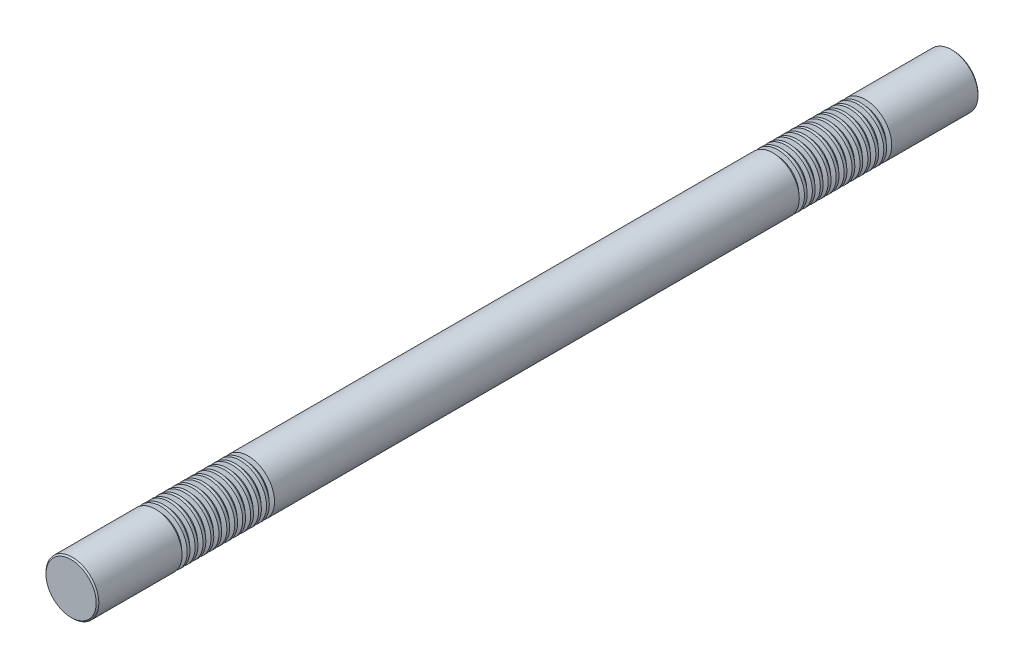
from build123d import *

# Parameters (mm, degrees)
SKETCH1_R           = 30
BOSS_EXTRUDE1_DEPTH = 500
CHAMFER1_SIZE       = 1.5
LPATTERN1_COUNT     = 12
LPATTERN1_PITCH     = 9
LPATTERN2_COUNT     = 2
LPATTERN2_PITCH     = 700


with BuildPart() as part:
    # Sketch1 → Boss-Extrude1 (new, symmetric)
    with BuildSketch(Plane.XY):
        Circle(SKETCH1_R)
    extrude(amount=BOSS_EXTRUDE1_DEPTH, both=True)

    # Chamfer1
    chamfer1_edges = [part.edges().sort_by_distance(p)[0] for p in [
        (-30, 0, -500),
        (-30, 0, 500),
    ]]
    chamfer(chamfer1_edges, length=CHAMFER1_SIZE)

    # Sketch2 → Cut-Revolve1 (revolve, cut)
    with BuildSketch(Plane(origin=(0, 0, 0), x_dir=(0, 0, -1), z_dir=(1, 0, 0)), mode=Mode.PRIVATE) as cut_revolve1_sk:
        Polygon((400.669872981, 30), (394.830127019, 30), (396.169872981, 25), (399.330127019, 25), align=None)
    cut_revolve1 = revolve(cut_revolve1_sk.sketch.rotate(Axis((0, 0, 500), (0, 0, -1)), 90), axis=Axis((0, 0, 500), (0, 0, -1)), mode=Mode.SUBTRACT)

    # LPattern1: Cut-Revolve1 ×12
    with Locations(*[(0, 0, i * LPATTERN1_PITCH) for i in range(1, LPATTERN1_COUNT)]):
        add(cut_revolve1, mode=Mode.SUBTRACT)

    # LPattern2: Cut-Revolve1 ×2
    with Locations(*[(0, 0, i * LPATTERN2_PITCH) for i in range(1, LPATTERN2_COUNT)]):
        add(cut_revolve1, mode=Mode.SUBTRACT)

    # LPattern2 copy 1 sketch → LPattern2 copy 1 (revolve, cut)
    with BuildSketch(Plane(origin=(0, 0, 709), x_dir=(0, 0, -1), z_dir=(1, 0, 0))):
        Polygon((400.669872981, 30), (394.830127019, 30), (396.169872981, 25), (399.330127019, 25), align=None)
    revolve(axis=Axis((0, 0, 1209), (0, 0, -1)), mode=Mode.SUBTRACT)

    # LPattern2 copy 2 sketch → LPattern2 copy 2 (revolve, cut)
    with BuildSketch(Plane(origin=(0, 0, 718), x_dir=(0, 0, -1), z_dir=(1, 0, 0))):
        Polygon((400.669872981, 30), (394.830127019, 30), (396.169872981, 25), (399.330127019, 25), align=None)
    revolve(axis=Axis((0, 0, 1218), (0, 0, -1)), mode=Mode.SUBTRACT)

    # LPattern2 copy 3 sketch → LPattern2 copy 3 (revolve, cut)
    with BuildSketch(Plane(origin=(0, 0, 727), x_dir=(0, 0, -1), z_dir=(1, 0, 0))):
        Polygon((400.669872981, 30), (394.830127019, 30), (396.169872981, 25), (399.330127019, 25), align=None)
    revolve(axis=Axis((0, 0, 1227), (0, 0, -1)), mode=Mode.SUBTRACT)

    # LPattern2 copy 4 sketch → LPattern2 copy 4 (revolve, cut)
    with BuildSketch(Plane(origin=(0, 0, 736), x_dir=(0, 0, -1), z_dir=(1, 0, 0))):
        Polygon((400.669872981, 30), (394.830127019, 30), (396.169872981, 25), (399.330127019, 25), align=None)
    revolve(axis=Axis((0, 0, 1236), (0, 0, -1)), mode=Mode.SUBTRACT)

    # LPattern2 copy 5 sketch → LPattern2 copy 5 (revolve, cut)
    with BuildSketch(Plane(origin=(0, 0, 745), x_dir=(0, 0, -1), z_dir=(1, 0, 0))):
        Polygon((400.669872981, 30), (394.830127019, 30), (396.169872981, 25), (399.330127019, 25), align=None)
    revolve(axis=Axis((0, 0, 1245), (0, 0, -1)), mode=Mode.SUBTRACT)

    # LPattern2 copy 6 sketch → LPattern2 copy 6 (revolve, cut)
    with BuildSketch(Plane(origin=(0, 0, 754), x_dir=(0, 0, -1), z_dir=(1, 0, 0))):
        Polygon((400.669872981, 30), (394.830127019, 30), (396.169872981, 25), (399.330127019, 25), align=None)
    revolve(axis=Axis((0, 0, 1254), (0, 0, -1)), mode=Mode.SUBTRACT)

    # LPattern2 copy 7 sketch → LPattern2 copy 7 (revolve, cut)
    with BuildSketch(Plane(origin=(0, 0, 763), x_dir=(0, 0, -1), z_dir=(1, 0, 0))):
        Polygon((400.669872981, 30), (394.830127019, 30), (396.169872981, 25), (399.330127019, 25), align=None)
    revolve(axis=Axis((0, 0, 1263), (0, 0, -1)), mode=Mode.SUBTRACT)

    # LPattern2 copy 8 sketch → LPattern2 copy 8 (revolve, cut)
    with BuildSketch(Plane(origin=(0, 0, 772), x_dir=(0, 0, -1), z_dir=(1, 0, 0))):
        Polygon((400.669872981, 30), (394.830127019, 30), (396.169872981, 25), (399.330127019, 25), align=None)
    revolve(axis=Axis((0, 0, 1272), (0, 0, -1)), mode=Mode.SUBTRACT)

    # LPattern2 copy 9 sketch → LPattern2 copy 9 (revolve, cut)
    with BuildSketch(Plane(origin=(0, 0, 781), x_dir=(0, 0, -1), z_dir=(1, 0, 0))):
        Polygon((400.669872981, 30), (394.830127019, 30), (396.169872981, 25), (399.330127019, 25), align=None)
    revolve(axis=Axis((0, 0, 1281), (0, 0, -1)), mode=Mode.SUBTRACT)

    # LPattern2 copy 10 sketch → LPattern2 copy 10 (revolve, cut)
    with BuildSketch(Plane(origin=(0, 0, 790), x_dir=(0, 0, -1), z_dir=(1, 0, 0))):
        Polygon((400.669872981, 30), (394.830127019, 30), (396.169872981, 25), (399.330127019, 25), align=None)
    revolve(axis=Axis((0, 0, 1290), (0, 0, -1)), mode=Mode.SUBTRACT)

    # LPattern2 copy 11 sketch → LPattern2 copy 11 (revolve, cut)
    with BuildSketch(Plane(origin=(0, 0, 799), x_dir=(0, 0, -1), z_dir=(1, 0, 0))):
        Polygon((400.669872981, 30), (394.830127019, 30), (396.169872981, 25), (399.330127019, 25), align=None)
    revolve(axis=Axis((0, 0, 1299), (0, 0, -1)), mode=Mode.SUBTRACT)


solid = part.part
